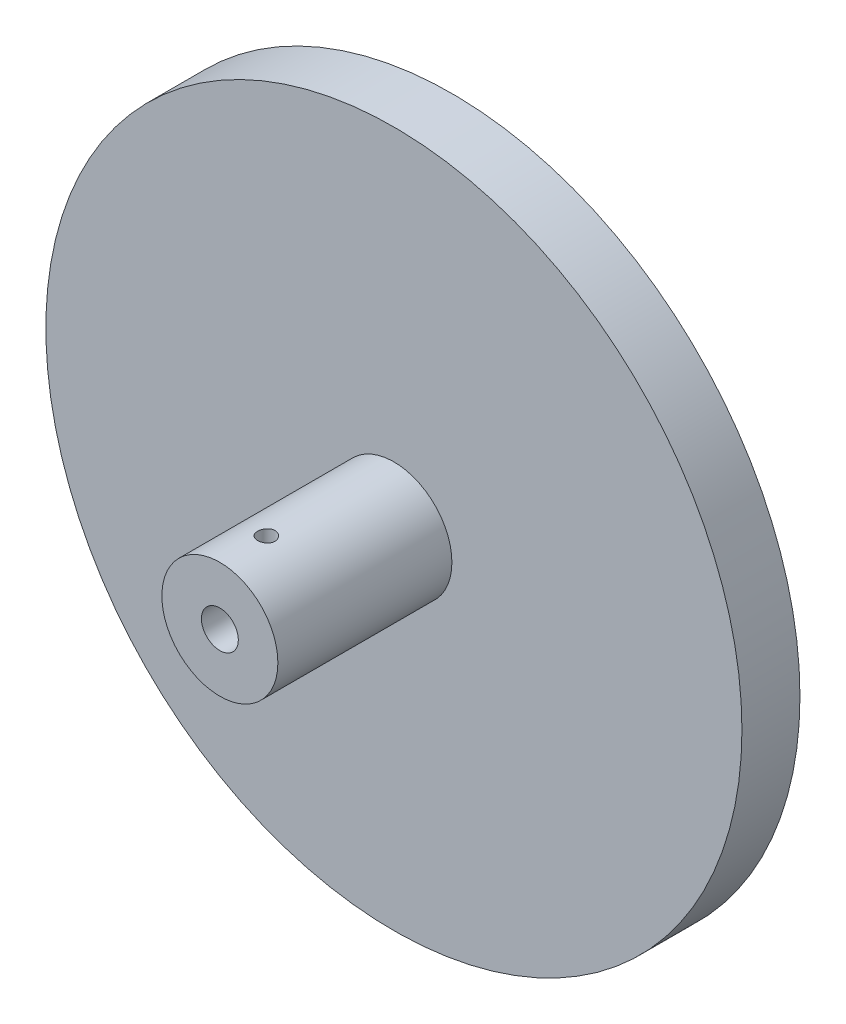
ISO-10303-21;
HEADER;
FILE_DESCRIPTION(('STEP AP214'),'2;1');
FILE_NAME('part.step','',(''),(''),'','','');
FILE_SCHEMA(('AUTOMOTIVE_DESIGN { 1 0 10303 214 1 1 1 1 }'));
ENDSEC;
DATA;
#1=APPLICATION_CONTEXT('core data for automotive mechanical design processes');
#2=APPLICATION_PROTOCOL_DEFINITION('international standard','automotive_design',2000,#1);
#3=PRODUCT_CONTEXT('',#1,'mechanical');
#4=PRODUCT('Part','Part','',(#3));
#5=PRODUCT_RELATED_PRODUCT_CATEGORY('part','',(#4));
#6=PRODUCT_DEFINITION_FORMATION('','',#4);
#7=PRODUCT_DEFINITION_CONTEXT('part definition',#1,'design');
#8=PRODUCT_DEFINITION('design','',#6,#7);
#9=PRODUCT_DEFINITION_SHAPE('','',#8);
#10=(LENGTH_UNIT() NAMED_UNIT(*) SI_UNIT(.MILLI.,.METRE.));
#11=(NAMED_UNIT(*) PLANE_ANGLE_UNIT() SI_UNIT($,.RADIAN.));
#12=(NAMED_UNIT(*) SI_UNIT($,.STERADIAN.) SOLID_ANGLE_UNIT());
#13=UNCERTAINTY_MEASURE_WITH_UNIT(LENGTH_MEASURE(1.E-05),#10,'distance_accuracy_value','');
#14=(GEOMETRIC_REPRESENTATION_CONTEXT(3) GLOBAL_UNCERTAINTY_ASSIGNED_CONTEXT((#13)) GLOBAL_UNIT_ASSIGNED_CONTEXT((#10,
#11,#12)) REPRESENTATION_CONTEXT('',''));
#15=CARTESIAN_POINT('',(0.,0.,0.));
#16=DIRECTION('',(0.,0.,1.));
#17=DIRECTION('',(1.,0.,0.));
#18=AXIS2_PLACEMENT_3D('',#15,#16,#17);
#19=CARTESIAN_POINT('',(0.,0.,10.));
#20=DIRECTION('',(0.,0.,-1.));
#21=DIRECTION('',(-1.,0.,0.));
#22=AXIS2_PLACEMENT_3D('',#19,#20,#21);
#23=CYLINDRICAL_SURFACE('',#22,60.);
#24=CARTESIAN_POINT('',(0.,0.,10.));
#25=DIRECTION('',(0.,0.,1.));
#26=DIRECTION('',(1.,0.,0.));
#27=AXIS2_PLACEMENT_3D('',#24,#25,#26);
#28=CIRCLE('',#27,60.);
#29=CARTESIAN_POINT('',(60.,0.,10.));
#30=VERTEX_POINT('',#29);
#31=EDGE_CURVE('E42',#30,#30,#28,.T.);
#32=ORIENTED_EDGE('',*,*,#31,.F.);
#33=EDGE_LOOP('',(#32));
#34=FACE_BOUND('',#33,.T.);
#35=CARTESIAN_POINT('',(0.,0.,0.));
#36=DIRECTION('',(0.,0.,1.));
#37=DIRECTION('',(1.,0.,0.));
#38=AXIS2_PLACEMENT_3D('',#35,#36,#37);
#39=CIRCLE('',#38,60.);
#40=CARTESIAN_POINT('',(60.,0.,0.));
#41=VERTEX_POINT('',#40);
#42=EDGE_CURVE('E38',#41,#41,#39,.T.);
#43=ORIENTED_EDGE('',*,*,#42,.T.);
#44=EDGE_LOOP('',(#43));
#45=FACE_BOUND('',#44,.T.);
#46=ADVANCED_FACE('F35',(#34,#45),#23,.T.);
#47=CARTESIAN_POINT('',(0.,0.,10.));
#48=DIRECTION('',(0.,0.,1.));
#49=DIRECTION('',(1.,0.,0.));
#50=AXIS2_PLACEMENT_3D('',#47,#48,#49);
#51=PLANE('',#50);
#52=CARTESIAN_POINT('',(0.,0.,10.));
#53=DIRECTION('',(0.,0.,1.));
#54=DIRECTION('',(1.,0.,0.));
#55=AXIS2_PLACEMENT_3D('',#52,#53,#54);
#56=CIRCLE('',#55,10.);
#57=CARTESIAN_POINT('',(10.,0.,10.));
#58=VERTEX_POINT('',#57);
#59=EDGE_CURVE('E10',#58,#58,#56,.T.);
#60=ORIENTED_EDGE('',*,*,#59,.F.);
#61=EDGE_LOOP('',(#60));
#62=FACE_BOUND('',#61,.T.);
#63=ORIENTED_EDGE('',*,*,#31,.T.);
#64=EDGE_LOOP('',(#63));
#65=FACE_BOUND('',#64,.T.);
#66=ADVANCED_FACE('F95',(#62,#65),#51,.T.);
#67=CARTESIAN_POINT('',(0.,0.,0.));
#68=DIRECTION('',(0.,0.,1.));
#69=DIRECTION('',(1.,0.,0.));
#70=AXIS2_PLACEMENT_3D('',#67,#68,#69);
#71=PLANE('',#70);
#72=ORIENTED_EDGE('',*,*,#42,.F.);
#73=EDGE_LOOP('',(#72));
#74=FACE_BOUND('',#73,.T.);
#75=ADVANCED_FACE('F93',(#74),#71,.F.);
#76=CARTESIAN_POINT('',(0.,0.,40.));
#77=DIRECTION('',(0.,0.,-1.));
#78=DIRECTION('',(-1.,0.,0.));
#79=AXIS2_PLACEMENT_3D('',#76,#77,#78);
#80=CYLINDRICAL_SURFACE('',#79,10.);
#81=CARTESIAN_POINT('',(0.,10.,33.5));
#82=CARTESIAN_POINT('',(0.0837515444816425,9.99999865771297,33.4999965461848));
#83=CARTESIAN_POINT('',(0.167551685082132,9.9989368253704,33.4929619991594));
#84=CARTESIAN_POINT('',(0.332809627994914,9.99480315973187,33.4650168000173));
#85=CARTESIAN_POINT('',(0.41426506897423,9.99172936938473,33.4440926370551));
#86=CARTESIAN_POINT('',(0.572418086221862,9.98391721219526,33.3890074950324));
#87=CARTESIAN_POINT('',(0.649119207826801,9.97918010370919,33.3548565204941));
#88=CARTESIAN_POINT('',(0.795690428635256,9.96856475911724,33.2743116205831));
#89=CARTESIAN_POINT('',(0.865561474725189,9.96268668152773,33.2279193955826));
#90=CARTESIAN_POINT('',(0.997046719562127,9.95039170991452,33.1238227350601));
#91=CARTESIAN_POINT('',(1.0585998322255,9.94397133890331,33.0660415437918));
#92=CARTESIAN_POINT('',(1.17117490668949,9.93134261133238,32.9409723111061));
#93=CARTESIAN_POINT('',(1.22219626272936,9.92513426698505,32.8736837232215));
#94=CARTESIAN_POINT('',(1.31249729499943,9.91359877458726,32.7310993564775));
#95=CARTESIAN_POINT('',(1.35171787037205,9.90827611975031,32.6557657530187));
#96=CARTESIAN_POINT('',(1.41692632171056,9.89916211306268,32.4994871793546));
#97=CARTESIAN_POINT('',(1.44291491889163,9.89537067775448,32.4185425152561));
#98=CARTESIAN_POINT('',(1.48073198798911,9.88978256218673,32.2539819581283));
#99=CARTESIAN_POINT('',(1.49266503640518,9.8879711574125,32.170390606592));
#100=CARTESIAN_POINT('',(1.50235624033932,9.88650348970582,32.0023738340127));
#101=CARTESIAN_POINT('',(1.50011520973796,9.88684710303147,31.9179484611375));
#102=CARTESIAN_POINT('',(1.48160733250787,9.88963718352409,31.7513989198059));
#103=CARTESIAN_POINT('',(1.4654569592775,9.89206618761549,31.6692614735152));
#104=CARTESIAN_POINT('',(1.41977117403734,9.89872608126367,31.5088756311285));
#105=CARTESIAN_POINT('',(1.39023538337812,9.90295702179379,31.4306273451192));
#106=CARTESIAN_POINT('',(1.31849603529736,9.91276335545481,31.2798866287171));
#107=CARTESIAN_POINT('',(1.27624314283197,9.91834396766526,31.2074180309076));
#108=CARTESIAN_POINT('',(1.18030413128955,9.93021707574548,31.0705554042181));
#109=CARTESIAN_POINT('',(1.12661726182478,9.93650961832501,31.0061619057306));
#110=CARTESIAN_POINT('',(1.00869493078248,9.94917473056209,30.8866023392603));
#111=CARTESIAN_POINT('',(0.944359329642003,9.95554747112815,30.8315350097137));
#112=CARTESIAN_POINT('',(0.807307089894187,9.96759647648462,30.7329640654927));
#113=CARTESIAN_POINT('',(0.734590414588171,9.9732727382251,30.6894605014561));
#114=CARTESIAN_POINT('',(0.582754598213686,9.98329515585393,30.6152469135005));
#115=CARTESIAN_POINT('',(0.50363167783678,9.98764051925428,30.5845445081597));
#116=CARTESIAN_POINT('',(0.34127318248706,9.99450490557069,30.5368906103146));
#117=CARTESIAN_POINT('',(0.2580378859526,9.99702405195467,30.5199381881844));
#118=CARTESIAN_POINT('',(0.0906695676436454,9.99993581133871,30.5003967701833));
#119=CARTESIAN_POINT('',(0.00655273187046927,10.0003485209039,30.4976720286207));
#120=CARTESIAN_POINT('',(-0.160936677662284,9.99905561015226,30.506303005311));
#121=CARTESIAN_POINT('',(-0.244309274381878,9.99735005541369,30.5176582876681));
#122=CARTESIAN_POINT('',(-0.407532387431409,9.99202468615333,30.5540141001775));
#123=CARTESIAN_POINT('',(-0.487397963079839,9.98841415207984,30.5789484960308));
#124=CARTESIAN_POINT('',(-0.641814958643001,9.97968235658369,30.6416849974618));
#125=CARTESIAN_POINT('',(-0.716366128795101,9.97456102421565,30.6794877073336));
#126=CARTESIAN_POINT('',(-0.858634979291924,9.96332682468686,30.7672062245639));
#127=CARTESIAN_POINT('',(-0.926299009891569,9.95720701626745,30.8172081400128));
#128=CARTESIAN_POINT('',(-1.05232367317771,9.94467863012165,30.9277858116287));
#129=CARTESIAN_POINT('',(-1.1106837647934,9.93827003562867,30.9883621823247));
#130=CARTESIAN_POINT('',(-1.21693784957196,9.92582264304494,31.1189735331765));
#131=CARTESIAN_POINT('',(-1.26474084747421,9.91978736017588,31.1890829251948));
#132=CARTESIAN_POINT('',(-1.34789129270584,9.90883219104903,31.3364160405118));
#133=CARTESIAN_POINT('',(-1.38323907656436,9.90391227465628,31.4136395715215));
#134=CARTESIAN_POINT('',(-1.44033467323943,9.89577033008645,31.5727375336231));
#135=CARTESIAN_POINT('',(-1.46213037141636,9.89254233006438,31.6545944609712));
#136=CARTESIAN_POINT('',(-1.49165549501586,9.88813382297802,31.8208590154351));
#137=CARTESIAN_POINT('',(-1.49938589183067,9.88695317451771,31.9052664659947));
#138=CARTESIAN_POINT('',(-1.5005378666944,9.88677832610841,32.0733290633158));
#139=CARTESIAN_POINT('',(-1.49410252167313,9.88776226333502,32.1569832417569));
#140=CARTESIAN_POINT('',(-1.46741229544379,9.89175820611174,32.3220052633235));
#141=CARTESIAN_POINT('',(-1.44715743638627,9.89477020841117,32.4033731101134));
#142=CARTESIAN_POINT('',(-1.39345373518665,9.90247526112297,32.5614730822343));
#143=CARTESIAN_POINT('',(-1.36001489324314,9.90716703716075,32.6382086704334));
#144=CARTESIAN_POINT('',(-1.28090667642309,9.91770454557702,32.7850036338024));
#145=CARTESIAN_POINT('',(-1.23523688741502,9.92355031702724,32.8550627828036));
#146=CARTESIAN_POINT('',(-1.13244337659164,9.93580743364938,32.9872430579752));
#147=CARTESIAN_POINT('',(-1.07521369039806,9.94222367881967,33.0492813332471));
#148=CARTESIAN_POINT('',(-0.951148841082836,9.95485788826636,33.1629245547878));
#149=CARTESIAN_POINT('',(-0.884311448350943,9.96107580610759,33.2145270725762));
#150=CARTESIAN_POINT('',(-0.742495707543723,9.9726518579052,33.3060876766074));
#151=CARTESIAN_POINT('',(-0.667474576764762,9.9780050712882,33.3459801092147));
#152=CARTESIAN_POINT('',(-0.51175187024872,9.98720028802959,33.4125385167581));
#153=CARTESIAN_POINT('',(-0.431056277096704,9.99104385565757,33.4392181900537));
#154=CARTESIAN_POINT('',(-0.291665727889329,9.99590939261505,33.4725413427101));
#155=CARTESIAN_POINT('',(-0.233831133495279,9.99743549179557,33.4828226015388));
#156=CARTESIAN_POINT('',(-0.117338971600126,9.99948125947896,33.4965530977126));
#157=CARTESIAN_POINT('',(-0.0586814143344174,10.0000009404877,33.5000024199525));
#158=CARTESIAN_POINT('',(0.,10.,33.5));
#159=B_SPLINE_CURVE_WITH_KNOTS('',3,(#81,#82,#83,#84,#85,#86,#87,#88,#89,#90,#91,#92,#93,#94,
#95,#96,#97,#98,#99,#100,#101,#102,#103,#104,#105,#106,#107,#108,#109,#110,#111,#112,#113,#114,
#115,#116,#117,#118,#119,#120,#121,#122,#123,#124,#125,#126,#127,#128,#129,#130,#131,#132,#133,
#134,#135,#136,#137,#138,#139,#140,#141,#142,#143,#144,#145,#146,#147,#148,#149,#150,#151,#152,
#153,#154,#155,#156,#157,#158),.UNSPECIFIED.,.T.,.F.,(4,2,2,2,2,2,2,2,2,2,2,2,2,2,2,2,2,2,2,2,2,
2,2,2,2,2,2,2,2,2,2,2,2,2,2,2,2,2,4),(0.,0.251040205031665,0.50232496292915,0.753420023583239,
1.0044802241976,1.25729416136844,1.5101226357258,1.76419702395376,2.01825756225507,
2.27041564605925,2.52255925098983,2.77261177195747,3.02267136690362,3.2737138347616,
3.52477278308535,3.77834291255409,4.03191415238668,4.28563608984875,4.53934087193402,
4.79062058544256,5.04189251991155,5.29195148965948,5.54202220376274,5.79391188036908,
6.0458162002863,6.29981366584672,6.55380426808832,6.80689223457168,7.05996272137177,
7.31048888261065,7.56101464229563,7.81135073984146,8.0616953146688,8.31444829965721,
8.56726003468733,8.82146323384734,9.07540233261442,9.25129851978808,9.42719252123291),.UNSPECIFIED.);
#160=CARTESIAN_POINT('',(0.,10.,33.5));
#161=VERTEX_POINT('',#160);
#162=EDGE_CURVE('E55',#161,#161,#159,.T.);
#163=ORIENTED_EDGE('',*,*,#162,.F.);
#164=EDGE_LOOP('',(#163));
#165=FACE_BOUND('',#164,.T.);
#166=CARTESIAN_POINT('',(0.,0.,40.));
#167=DIRECTION('',(0.,0.,1.));
#168=DIRECTION('',(1.,0.,0.));
#169=AXIS2_PLACEMENT_3D('',#166,#167,#168);
#170=CIRCLE('',#169,10.);
#171=CARTESIAN_POINT('',(10.,0.,40.));
#172=VERTEX_POINT('',#171);
#173=EDGE_CURVE('E48',#172,#172,#170,.T.);
#174=ORIENTED_EDGE('',*,*,#173,.F.);
#175=EDGE_LOOP('',(#174));
#176=FACE_BOUND('',#175,.T.);
#177=ORIENTED_EDGE('',*,*,#59,.T.);
#178=EDGE_LOOP('',(#177));
#179=FACE_BOUND('',#178,.T.);
#180=ADVANCED_FACE('F89',(#165,#176,#179),#80,.T.);
#181=CARTESIAN_POINT('',(0.,0.,40.));
#182=DIRECTION('',(0.,0.,1.));
#183=DIRECTION('',(1.,0.,0.));
#184=AXIS2_PLACEMENT_3D('',#181,#182,#183);
#185=PLANE('',#184);
#186=CARTESIAN_POINT('',(0.,0.,40.));
#187=DIRECTION('',(0.,0.,1.));
#188=DIRECTION('',(1.,0.,0.));
#189=AXIS2_PLACEMENT_3D('',#186,#187,#188);
#190=CIRCLE('',#189,3.18);
#191=CARTESIAN_POINT('',(3.18,0.,40.));
#192=VERTEX_POINT('',#191);
#193=EDGE_CURVE('E52',#192,#192,#190,.T.);
#194=ORIENTED_EDGE('',*,*,#193,.F.);
#195=EDGE_LOOP('',(#194));
#196=FACE_BOUND('',#195,.T.);
#197=ORIENTED_EDGE('',*,*,#173,.T.);
#198=EDGE_LOOP('',(#197));
#199=FACE_BOUND('',#198,.T.);
#200=ADVANCED_FACE('F85',(#196,#199),#185,.T.);
#201=CARTESIAN_POINT('',(0.,0.,10.));
#202=DIRECTION('',(0.,0.,1.));
#203=DIRECTION('',(1.,0.,0.));
#204=AXIS2_PLACEMENT_3D('',#201,#202,#203);
#205=CYLINDRICAL_SURFACE('',#204,3.18);
#206=CARTESIAN_POINT('',(0.,3.18,33.5));
#207=CARTESIAN_POINT('',(-0.0793831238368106,3.17999623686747,33.4999955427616));
#208=CARTESIAN_POINT('',(-0.158876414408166,3.17699489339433,33.4936611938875));
#209=CARTESIAN_POINT('',(-0.315546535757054,3.16528568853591,33.4685884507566));
#210=CARTESIAN_POINT('',(-0.392717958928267,3.15656544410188,33.4498231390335));
#211=CARTESIAN_POINT('',(-0.542233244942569,3.13433801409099,33.4007673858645));
#212=CARTESIAN_POINT('',(-0.61459395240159,3.12084870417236,33.3705199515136));
#213=CARTESIAN_POINT('',(-0.753122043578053,3.09034707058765,33.2995648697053));
#214=CARTESIAN_POINT('',(-0.819290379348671,3.07333528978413,33.2588588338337));
#215=CARTESIAN_POINT('',(-0.947697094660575,3.03627749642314,33.1655532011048));
#216=CARTESIAN_POINT('',(-1.00951248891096,3.01611537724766,33.1124182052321));
#217=CARTESIAN_POINT('',(-1.12373612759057,2.97544955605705,32.9969064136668));
#218=CARTESIAN_POINT('',(-1.17613803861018,2.95494563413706,32.9345234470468));
#219=CARTESIAN_POINT('',(-1.27355092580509,2.91435040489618,32.7972540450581));
#220=CARTESIAN_POINT('',(-1.31783155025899,2.89437876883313,32.7218099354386));
#221=CARTESIAN_POINT('',(-1.39289016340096,2.85901916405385,32.5634868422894));
#222=CARTESIAN_POINT('',(-1.42367693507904,2.84362821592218,32.4806127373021));
#223=CARTESIAN_POINT('',(-1.46901312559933,2.820464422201,32.3146040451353));
#224=CARTESIAN_POINT('',(-1.4843818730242,2.81231019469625,32.2317488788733));
#225=CARTESIAN_POINT('',(-1.5009781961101,2.80349119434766,32.0642667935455));
#226=CARTESIAN_POINT('',(-1.50221719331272,2.80282037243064,31.9796413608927));
#227=CARTESIAN_POINT('',(-1.49112457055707,2.80873097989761,31.820412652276));
#228=CARTESIAN_POINT('',(-1.48018419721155,2.81456900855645,31.7456785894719));
#229=CARTESIAN_POINT('',(-1.44742638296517,2.83155322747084,31.5992669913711));
#230=CARTESIAN_POINT('',(-1.42560605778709,2.84270082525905,31.5275902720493));
#231=CARTESIAN_POINT('',(-1.37128314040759,2.86930503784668,31.3873226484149));
#232=CARTESIAN_POINT('',(-1.33854492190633,2.88485544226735,31.318841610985));
#233=CARTESIAN_POINT('',(-1.26348940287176,2.91850714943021,31.1880350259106));
#234=CARTESIAN_POINT('',(-1.22116788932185,2.93660957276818,31.1257122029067));
#235=CARTESIAN_POINT('',(-1.12264583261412,2.97576450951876,31.0016942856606));
#236=CARTESIAN_POINT('',(-1.06542522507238,2.99692121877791,30.9408397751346));
#237=CARTESIAN_POINT('',(-0.941453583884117,3.03814609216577,30.8292639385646));
#238=CARTESIAN_POINT('',(-0.874698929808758,3.05821383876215,30.7785464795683));
#239=CARTESIAN_POINT('',(-0.730380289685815,3.09591708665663,30.6869456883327));
#240=CARTESIAN_POINT('',(-0.652507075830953,3.11343467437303,30.6464972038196));
#241=CARTESIAN_POINT('',(-0.490023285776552,3.14309986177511,30.5795841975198));
#242=CARTESIAN_POINT('',(-0.405417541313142,3.15525127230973,30.5531097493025));
#243=CARTESIAN_POINT('',(-0.238806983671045,3.17204027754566,30.516869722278));
#244=CARTESIAN_POINT('',(-0.157097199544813,3.17718094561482,30.5059822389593));
#245=CARTESIAN_POINT('',(0.00713977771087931,3.18105094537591,30.4977679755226));
#246=CARTESIAN_POINT('',(0.0896666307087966,3.17978284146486,30.5004357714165));
#247=CARTESIAN_POINT('',(0.247316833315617,3.17128561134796,30.518545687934));
#248=CARTESIAN_POINT('',(0.322564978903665,3.16446286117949,30.5331171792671));
#249=CARTESIAN_POINT('',(0.469421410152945,3.14603296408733,30.5733110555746));
#250=CARTESIAN_POINT('',(0.541029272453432,3.13442526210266,30.5989347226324));
#251=CARTESIAN_POINT('',(0.681067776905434,3.10705562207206,30.6612688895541));
#252=CARTESIAN_POINT('',(0.749335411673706,3.09117801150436,30.6982930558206));
#253=CARTESIAN_POINT('',(0.87892922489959,3.05685860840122,30.7820334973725));
#254=CARTESIAN_POINT('',(0.940252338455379,3.03841569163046,30.8287540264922));
#255=CARTESIAN_POINT('',(1.0600146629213,2.99884867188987,30.9354063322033));
#256=CARTESIAN_POINT('',(1.11770562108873,2.97763228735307,30.996145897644));
#257=CARTESIAN_POINT('',(1.22236980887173,2.9362198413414,31.1266095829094));
#258=CARTESIAN_POINT('',(1.26933759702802,2.91602430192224,31.19633823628));
#259=CARTESIAN_POINT('',(1.35269477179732,2.87833063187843,31.3459394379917));
#260=CARTESIAN_POINT('',(1.38866128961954,2.86095019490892,31.426079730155));
#261=CARTESIAN_POINT('',(1.44622081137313,2.83229522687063,31.5923686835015));
#262=CARTESIAN_POINT('',(1.4678301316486,2.82101376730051,31.6785104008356));
#263=CARTESIAN_POINT('',(1.49424578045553,2.80710387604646,31.8459147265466));
#264=CARTESIAN_POINT('',(1.50040505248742,2.80377999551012,31.9269056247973));
#265=CARTESIAN_POINT('',(1.49955390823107,2.80423625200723,32.0887863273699));
#266=CARTESIAN_POINT('',(1.49254743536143,2.80801426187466,32.169676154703));
#267=CARTESIAN_POINT('',(1.46679013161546,2.82154384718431,32.3226216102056));
#268=CARTESIAN_POINT('',(1.44897264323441,2.83081945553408,32.3948813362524));
#269=CARTESIAN_POINT('',(1.4031630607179,2.85380207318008,32.5353454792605));
#270=CARTESIAN_POINT('',(1.3751679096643,2.86751041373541,32.6035486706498));
#271=CARTESIAN_POINT('',(1.3076843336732,2.89893640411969,32.7389593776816));
#272=CARTESIAN_POINT('',(1.26755482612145,2.91686021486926,32.8057983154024));
#273=CARTESIAN_POINT('',(1.17771208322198,2.95427849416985,32.9322090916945));
#274=CARTESIAN_POINT('',(1.12799427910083,2.9737737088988,32.9917774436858));
#275=CARTESIAN_POINT('',(1.01433269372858,3.01455404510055,33.1083412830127));
#276=CARTESIAN_POINT('',(0.949449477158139,3.03581579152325,33.1644337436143));
#277=CARTESIAN_POINT('',(0.810509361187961,3.07582432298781,33.2650816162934));
#278=CARTESIAN_POINT('',(0.736448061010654,3.09456989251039,33.3096314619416));
#279=CARTESIAN_POINT('',(0.581219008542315,3.12743569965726,33.3855037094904));
#280=CARTESIAN_POINT('',(0.500078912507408,3.1415729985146,33.4168750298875));
#281=CARTESIAN_POINT('',(0.332939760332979,3.16363755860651,33.4651520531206));
#282=CARTESIAN_POINT('',(0.246955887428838,3.17158318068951,33.4821005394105));
#283=CARTESIAN_POINT('',(0.133548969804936,3.17730742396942,33.494283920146));
#284=CARTESIAN_POINT('',(0.106898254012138,3.17831503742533,33.4964250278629));
#285=CARTESIAN_POINT('',(0.0535025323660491,3.1796619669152,33.4992838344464));
#286=CARTESIAN_POINT('',(0.0267575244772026,3.1800012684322,33.5000015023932));
#287=CARTESIAN_POINT('',(0.,3.18,33.5));
#288=B_SPLINE_CURVE_WITH_KNOTS('',3,(#206,#207,#208,#209,#210,#211,#212,#213,#214,#215,#216,
#217,#218,#219,#220,#221,#222,#223,#224,#225,#226,#227,#228,#229,#230,#231,#232,#233,#234,#235,
#236,#237,#238,#239,#240,#241,#242,#243,#244,#245,#246,#247,#248,#249,#250,#251,#252,#253,#254,
#255,#256,#257,#258,#259,#260,#261,#262,#263,#264,#265,#266,#267,#268,#269,#270,#271,#272,#273,
#274,#275,#276,#277,#278,#279,#280,#281,#282,#283,#284,#285,#286,#287),.UNSPECIFIED.,.T.,.F.,(4,
2,2,2,2,2,2,2,2,2,2,2,2,2,2,2,2,2,2,2,2,2,2,2,2,2,2,2,2,2,2,2,2,2,2,2,2,2,2,2,4),(0.,
0.238040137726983,0.476597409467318,0.714269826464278,0.951905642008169,1.20275252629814,
1.45376755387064,1.72159931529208,1.98925648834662,2.24178689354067,2.49411315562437,
2.72032440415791,2.94659565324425,3.17810568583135,3.4097176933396,3.66708705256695,
3.92455440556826,4.19157746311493,4.45841058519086,4.70486024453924,4.95121129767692,
5.1810047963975,5.41082495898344,5.64763906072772,5.88455727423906,6.14266137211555,
6.40089615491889,6.66807758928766,6.93495486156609,7.17748784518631,7.41994819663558,
7.64397584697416,7.86807084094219,8.10708492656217,8.34621318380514,8.61006913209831,
8.87405208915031,9.13704629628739,9.39925761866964,9.47949163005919,9.55972738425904),.UNSPECIFIED.);
#289=CARTESIAN_POINT('',(0.,3.18,33.5));
#290=VERTEX_POINT('',#289);
#291=EDGE_CURVE('E58',#290,#290,#288,.T.);
#292=ORIENTED_EDGE('',*,*,#291,.F.);
#293=EDGE_LOOP('',(#292));
#294=FACE_BOUND('',#293,.T.);
#295=CARTESIAN_POINT('',(0.,0.,10.));
#296=DIRECTION('',(0.,0.,1.));
#297=DIRECTION('',(1.,0.,0.));
#298=AXIS2_PLACEMENT_3D('',#295,#296,#297);
#299=CIRCLE('',#298,3.18);
#300=CARTESIAN_POINT('',(3.18,0.,10.));
#301=VERTEX_POINT('',#300);
#302=EDGE_CURVE('E51',#301,#301,#299,.T.);
#303=ORIENTED_EDGE('',*,*,#302,.F.);
#304=EDGE_LOOP('',(#303));
#305=FACE_BOUND('',#304,.T.);
#306=ORIENTED_EDGE('',*,*,#193,.T.);
#307=EDGE_LOOP('',(#306));
#308=FACE_BOUND('',#307,.T.);
#309=ADVANCED_FACE('F81',(#294,#305,#308),#205,.F.);
#310=CARTESIAN_POINT('',(0.,0.,10.));
#311=DIRECTION('',(0.,0.,1.));
#312=DIRECTION('',(1.,0.,0.));
#313=AXIS2_PLACEMENT_3D('',#310,#311,#312);
#314=PLANE('',#313);
#315=ORIENTED_EDGE('',*,*,#302,.T.);
#316=EDGE_LOOP('',(#315));
#317=FACE_BOUND('',#316,.T.);
#318=ADVANCED_FACE('F74',(#317),#314,.T.);
#319=CARTESIAN_POINT('',(0.,-60.001,32.));
#320=DIRECTION('',(0.,1.,0.));
#321=DIRECTION('',(0.,0.,1.));
#322=AXIS2_PLACEMENT_3D('',#319,#320,#321);
#323=CYLINDRICAL_SURFACE('',#322,1.5);
#324=ORIENTED_EDGE('',*,*,#291,.T.);
#325=EDGE_LOOP('',(#324));
#326=FACE_BOUND('',#325,.T.);
#327=ORIENTED_EDGE('',*,*,#162,.T.);
#328=EDGE_LOOP('',(#327));
#329=FACE_BOUND('',#328,.T.);
#330=ADVANCED_FACE('F70',(#326,#329),#323,.F.);
#331=CLOSED_SHELL('',(#46,#66,#75,#180,#200,#309,#318,#330));
#332=MANIFOLD_SOLID_BREP('B2',#331);
#333=ADVANCED_BREP_SHAPE_REPRESENTATION('',(#18,#332),#14);
#334=SHAPE_DEFINITION_REPRESENTATION(#9,#333);
ENDSEC;
END-ISO-10303-21;
